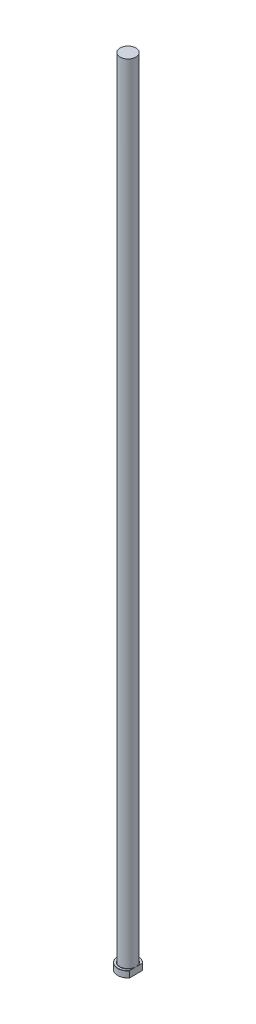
from build123d import *
from build123d.topology import SkipClean

# Parameters (mm, degrees)
CHAMFER1_SIZE = 0.2
FILLET1_R     = 0.3
KEY_DEPTH     = 1001.168985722


with BuildPart() as part:
    # Sketch1 → Revolve1 (revolve)
    with BuildSketch(Plane.XY, mode=Mode.PRIVATE) as revolve1_sk:
        Polygon((0, 0), (-13, 0), (-13, 8), (-10, 8), (-10, 1000), (0, 1000), align=None)
    revolve(revolve1_sk.sketch.rotate(Axis((0, 259.958771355, 0), (0, -1, 0)), 270), axis=Axis((0, 259.958771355, 0), (0, -1, 0)))

    # Chamfer1
    chamfer1_edges = [part.edges().sort_by_distance(p)[0] for p in [
        (0, 8, -13),
        (0, 0, -13),
    ]]
    chamfer(chamfer1_edges, length=CHAMFER1_SIZE)

    # Fillet1
    fillet1_edges = [part.edges().sort_by_distance(p)[0] for p in [
        (0, 8, -10),
    ]]
    fillet(fillet1_edges, radius=FILLET1_R)

    # Sketch2 → KEY (cut, through all)
    with SkipClean():  # the faces are left unmerged after this step: merging them gives an invalid solid
        with BuildSketch(Plane(origin=(0, 0, 0), x_dir=(1, 0, 0), z_dir=(0, 1, 0))):
            with BuildLine():
                Line((10, 8.306623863), (10, -8.306623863))
                ThreePointArc((10, -8.306623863), (13, 0), (10, 8.306623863))
            make_face()
        extrude(amount=KEY_DEPTH, mode=Mode.SUBTRACT)


solid = part.part
